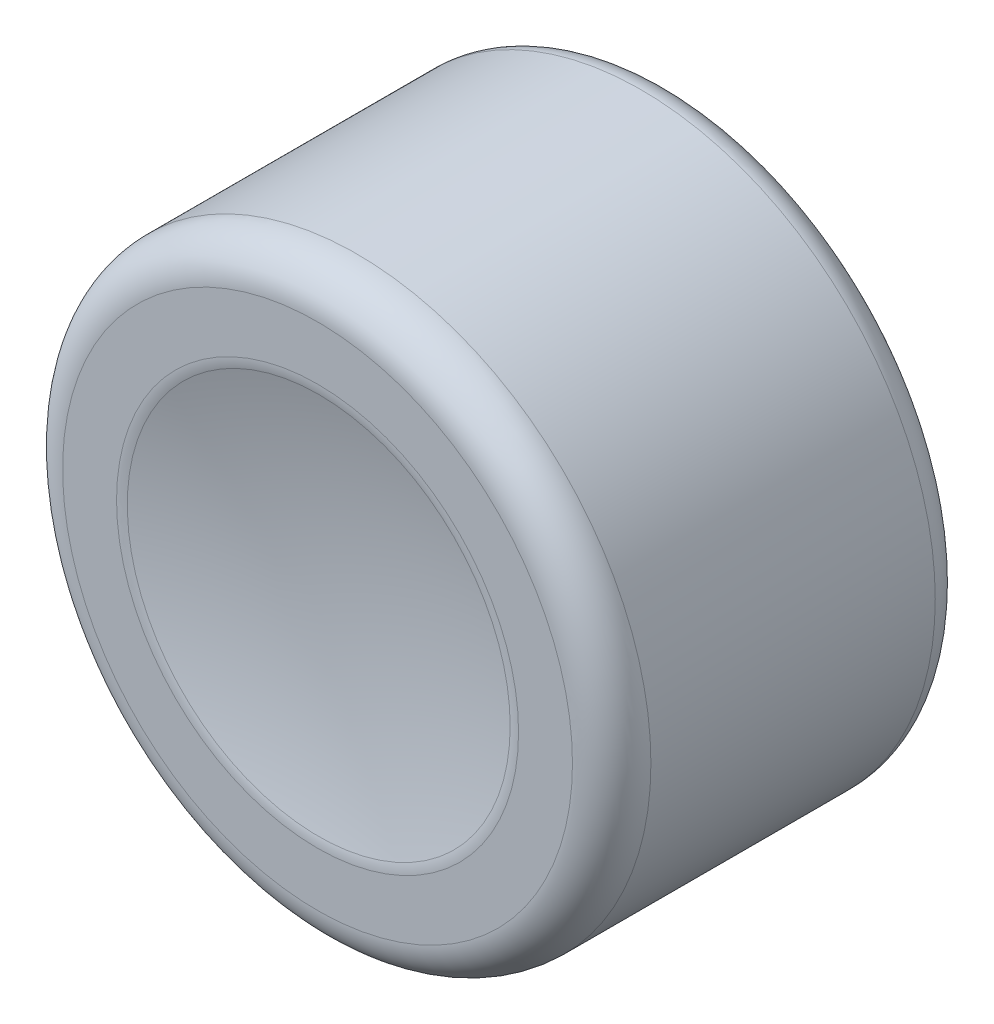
ISO-10303-21;
HEADER;
FILE_DESCRIPTION(('STEP AP214'),'2;1');
FILE_NAME('part.step','',(''),(''),'','','');
FILE_SCHEMA(('AUTOMOTIVE_DESIGN { 1 0 10303 214 1 1 1 1 }'));
ENDSEC;
DATA;
#1=APPLICATION_CONTEXT('core data for automotive mechanical design processes');
#2=APPLICATION_PROTOCOL_DEFINITION('international standard','automotive_design',2000,#1);
#3=PRODUCT_CONTEXT('',#1,'mechanical');
#4=PRODUCT('Part','Part','',(#3));
#5=PRODUCT_RELATED_PRODUCT_CATEGORY('part','',(#4));
#6=PRODUCT_DEFINITION_FORMATION('','',#4);
#7=PRODUCT_DEFINITION_CONTEXT('part definition',#1,'design');
#8=PRODUCT_DEFINITION('design','',#6,#7);
#9=PRODUCT_DEFINITION_SHAPE('','',#8);
#10=(LENGTH_UNIT() NAMED_UNIT(*) SI_UNIT(.MILLI.,.METRE.));
#11=(NAMED_UNIT(*) PLANE_ANGLE_UNIT() SI_UNIT($,.RADIAN.));
#12=(NAMED_UNIT(*) SI_UNIT($,.STERADIAN.) SOLID_ANGLE_UNIT());
#13=UNCERTAINTY_MEASURE_WITH_UNIT(LENGTH_MEASURE(1.E-05),#10,'distance_accuracy_value','');
#14=(GEOMETRIC_REPRESENTATION_CONTEXT(3) GLOBAL_UNCERTAINTY_ASSIGNED_CONTEXT((#13)) GLOBAL_UNIT_ASSIGNED_CONTEXT((#10,
#11,#12)) REPRESENTATION_CONTEXT('',''));
#15=CARTESIAN_POINT('',(0.,0.,0.));
#16=DIRECTION('',(0.,0.,1.));
#17=DIRECTION('',(1.,0.,0.));
#18=AXIS2_PLACEMENT_3D('',#15,#16,#17);
#19=CARTESIAN_POINT('',(0.,0.,18.));
#20=DIRECTION('',(0.,0.,-1.));
#21=DIRECTION('',(-1.,0.,0.));
#22=AXIS2_PLACEMENT_3D('',#19,#20,#21);
#23=CYLINDRICAL_SURFACE('',#22,15.);
#24=CARTESIAN_POINT('',(0.,0.,1.5));
#25=DIRECTION('',(0.,0.,1.));
#26=DIRECTION('',(1.,0.,0.));
#27=AXIS2_PLACEMENT_3D('',#24,#25,#26);
#28=CIRCLE('',#27,15.);
#29=CARTESIAN_POINT('',(15.,0.,1.5));
#30=VERTEX_POINT('',#29);
#31=EDGE_CURVE('E50',#30,#30,#28,.T.);
#32=ORIENTED_EDGE('',*,*,#31,.T.);
#33=EDGE_LOOP('',(#32));
#34=FACE_BOUND('',#33,.T.);
#35=CARTESIAN_POINT('',(0.,0.,16.));
#36=DIRECTION('',(0.,0.,1.));
#37=DIRECTION('',(1.,0.,0.));
#38=AXIS2_PLACEMENT_3D('',#35,#36,#37);
#39=CIRCLE('',#38,15.);
#40=CARTESIAN_POINT('',(15.,0.,16.));
#41=VERTEX_POINT('',#40);
#42=EDGE_CURVE('E56',#41,#41,#39,.F.);
#43=ORIENTED_EDGE('',*,*,#42,.T.);
#44=EDGE_LOOP('',(#43));
#45=FACE_BOUND('',#44,.T.);
#46=ADVANCED_FACE('F22',(#34,#45),#23,.T.);
#47=CARTESIAN_POINT('',(0.,0.,18.));
#48=DIRECTION('',(0.,0.,1.));
#49=DIRECTION('',(1.,0.,0.));
#50=AXIS2_PLACEMENT_3D('',#47,#48,#49);
#51=PLANE('',#50);
#52=CARTESIAN_POINT('',(0.,0.,18.));
#53=DIRECTION('',(0.,0.,1.));
#54=DIRECTION('',(1.,0.,0.));
#55=AXIS2_PLACEMENT_3D('',#52,#53,#54);
#56=CIRCLE('',#55,13.);
#57=CARTESIAN_POINT('',(13.,0.,18.));
#58=VERTEX_POINT('',#57);
#59=EDGE_CURVE('E59',#58,#58,#56,.T.);
#60=ORIENTED_EDGE('',*,*,#59,.T.);
#61=EDGE_LOOP('',(#60));
#62=FACE_BOUND('',#61,.T.);
#63=CARTESIAN_POINT('',(0.,0.,18.));
#64=DIRECTION('',(0.,0.,1.));
#65=DIRECTION('',(1.,0.,0.));
#66=AXIS2_PLACEMENT_3D('',#63,#64,#65);
#67=CIRCLE('',#66,10.2508861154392);
#68=CARTESIAN_POINT('',(10.2508861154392,0.,18.));
#69=VERTEX_POINT('',#68);
#70=EDGE_CURVE('E62',#69,#69,#67,.F.);
#71=ORIENTED_EDGE('',*,*,#70,.T.);
#72=EDGE_LOOP('',(#71));
#73=FACE_BOUND('',#72,.T.);
#74=ADVANCED_FACE('F66',(#62,#73),#51,.T.);
#75=CARTESIAN_POINT('',(0.,0.,0.));
#76=DIRECTION('',(0.,0.,1.));
#77=DIRECTION('',(1.,0.,0.));
#78=AXIS2_PLACEMENT_3D('',#75,#76,#77);
#79=PLANE('',#78);
#80=CARTESIAN_POINT('',(0.,0.,0.));
#81=DIRECTION('',(0.,0.,1.));
#82=DIRECTION('',(1.,0.,0.));
#83=AXIS2_PLACEMENT_3D('',#80,#81,#82);
#84=CIRCLE('',#83,13.);
#85=CARTESIAN_POINT('',(13.,0.,0.));
#86=VERTEX_POINT('',#85);
#87=EDGE_CURVE('E44',#86,#86,#84,.T.);
#88=ORIENTED_EDGE('',*,*,#87,.T.);
#89=EDGE_LOOP('',(#88));
#90=FACE_BOUND('',#89,.T.);
#91=CARTESIAN_POINT('',(0.,0.,0.));
#92=DIRECTION('',(0.,0.,1.));
#93=DIRECTION('',(1.,0.,0.));
#94=AXIS2_PLACEMENT_3D('',#91,#92,#93);
#95=CIRCLE('',#94,13.5);
#96=CARTESIAN_POINT('',(13.5,0.,0.));
#97=VERTEX_POINT('',#96);
#98=EDGE_CURVE('E47',#97,#97,#95,.F.);
#99=ORIENTED_EDGE('',*,*,#98,.T.);
#100=EDGE_LOOP('',(#99));
#101=FACE_BOUND('',#100,.T.);
#102=ADVANCED_FACE('F91',(#90,#101),#79,.F.);
#103=CARTESIAN_POINT('',(0.,0.,56.7298334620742));
#104=DIRECTION('',(0.,0.,-1.));
#105=DIRECTION('',(0.,1.,0.));
#106=AXIS2_PLACEMENT_3D('',#103,#104,#105);
#107=SPHERICAL_SURFACE('',#106,40.);
#108=CARTESIAN_POINT('',(0.,0.,17.9395158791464));
#109=DIRECTION('',(0.,0.,1.));
#110=DIRECTION('',(1.,0.,0.));
#111=AXIS2_PLACEMENT_3D('',#108,#109,#110);
#112=CIRCLE('',#111,9.76274868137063);
#113=CARTESIAN_POINT('',(9.76274868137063,0.,17.9395158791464));
#114=VERTEX_POINT('',#113);
#115=EDGE_CURVE('E53',#114,#114,#112,.T.);
#116=ORIENTED_EDGE('',*,*,#115,.T.);
#117=EDGE_LOOP('',(#116));
#118=FACE_BOUND('',#117,.T.);
#119=ADVANCED_FACE('F81',(#118),#107,.F.);
#120=CARTESIAN_POINT('',(0.,0.,16.));
#121=DIRECTION('',(0.,0.,1.));
#122=DIRECTION('',(1.,0.,0.));
#123=AXIS2_PLACEMENT_3D('',#120,#121,#122);
#124=TOROIDAL_SURFACE('',#123,13.,2.);
#125=ORIENTED_EDGE('',*,*,#42,.F.);
#126=EDGE_LOOP('',(#125));
#127=FACE_BOUND('',#126,.T.);
#128=ORIENTED_EDGE('',*,*,#59,.F.);
#129=EDGE_LOOP('',(#128));
#130=FACE_BOUND('',#129,.T.);
#131=ADVANCED_FACE('F71',(#127,#130),#124,.T.);
#132=CARTESIAN_POINT('',(0.,0.,16.));
#133=DIRECTION('',(0.,0.,1.));
#134=DIRECTION('',(1.,0.,0.));
#135=AXIS2_PLACEMENT_3D('',#132,#133,#134);
#136=TOROIDAL_SURFACE('',#135,10.2508861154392,2.);
#137=ORIENTED_EDGE('',*,*,#115,.F.);
#138=EDGE_LOOP('',(#137));
#139=FACE_BOUND('',#138,.T.);
#140=ORIENTED_EDGE('',*,*,#70,.F.);
#141=EDGE_LOOP('',(#140));
#142=FACE_BOUND('',#141,.T.);
#143=ADVANCED_FACE('F68',(#139,#142),#136,.T.);
#144=CARTESIAN_POINT('',(0.,0.,18.));
#145=DIRECTION('',(0.,0.,-1.));
#146=DIRECTION('',(-1.,0.,0.));
#147=AXIS2_PLACEMENT_3D('',#144,#145,#146);
#148=CYLINDRICAL_SURFACE('',#147,12.5);
#149=CARTESIAN_POINT('',(0.,0.,14.5));
#150=DIRECTION('',(0.,0.,1.));
#151=DIRECTION('',(1.,0.,0.));
#152=AXIS2_PLACEMENT_3D('',#149,#150,#151);
#153=CIRCLE('',#152,12.5);
#154=CARTESIAN_POINT('',(12.5,0.,14.5));
#155=VERTEX_POINT('',#154);
#156=EDGE_CURVE('E36',#155,#155,#153,.T.);
#157=ORIENTED_EDGE('',*,*,#156,.T.);
#158=EDGE_LOOP('',(#157));
#159=FACE_BOUND('',#158,.T.);
#160=CARTESIAN_POINT('',(0.,0.,0.500000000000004));
#161=DIRECTION('',(0.,0.,1.));
#162=DIRECTION('',(1.,0.,0.));
#163=AXIS2_PLACEMENT_3D('',#160,#161,#162);
#164=CIRCLE('',#163,12.5);
#165=CARTESIAN_POINT('',(12.5,0.,0.500000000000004));
#166=VERTEX_POINT('',#165);
#167=EDGE_CURVE('E41',#166,#166,#164,.F.);
#168=ORIENTED_EDGE('',*,*,#167,.T.);
#169=EDGE_LOOP('',(#168));
#170=FACE_BOUND('',#169,.T.);
#171=ADVANCED_FACE('F70',(#159,#170),#148,.F.);
#172=CARTESIAN_POINT('',(0.,0.,15.5));
#173=DIRECTION('',(0.,0.,1.));
#174=DIRECTION('',(1.,0.,0.));
#175=AXIS2_PLACEMENT_3D('',#172,#173,#174);
#176=PLANE('',#175);
#177=CARTESIAN_POINT('',(0.,0.,15.5));
#178=DIRECTION('',(0.,0.,1.));
#179=DIRECTION('',(1.,0.,0.));
#180=AXIS2_PLACEMENT_3D('',#177,#178,#179);
#181=CIRCLE('',#180,11.5);
#182=CARTESIAN_POINT('',(11.5,0.,15.5));
#183=VERTEX_POINT('',#182);
#184=EDGE_CURVE('E28',#183,#183,#181,.F.);
#185=ORIENTED_EDGE('',*,*,#184,.T.);
#186=EDGE_LOOP('',(#185));
#187=FACE_BOUND('',#186,.T.);
#188=CARTESIAN_POINT('',(0.,0.,15.5));
#189=DIRECTION('',(0.,0.,1.));
#190=DIRECTION('',(1.,0.,0.));
#191=AXIS2_PLACEMENT_3D('',#188,#189,#190);
#192=CIRCLE('',#191,10.4350929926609);
#193=CARTESIAN_POINT('',(10.4350929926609,0.,15.5));
#194=VERTEX_POINT('',#193);
#195=EDGE_CURVE('E32',#194,#194,#192,.T.);
#196=ORIENTED_EDGE('',*,*,#195,.T.);
#197=EDGE_LOOP('',(#196));
#198=FACE_BOUND('',#197,.T.);
#199=ADVANCED_FACE('F78',(#187,#198),#176,.F.);
#200=CARTESIAN_POINT('',(0.,0.,56.7298334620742));
#201=DIRECTION('',(0.,0.,-1.));
#202=DIRECTION('',(0.,1.,0.));
#203=AXIS2_PLACEMENT_3D('',#200,#201,#202);
#204=SPHERICAL_SURFACE('',#203,42.5);
#205=CARTESIAN_POINT('',(0.,0.,15.4708007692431));
#206=DIRECTION('',(0.,0.,1.));
#207=DIRECTION('',(1.,0.,0.));
#208=AXIS2_PLACEMENT_3D('',#205,#206,#207);
#209=CIRCLE('',#208,10.1952057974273);
#210=CARTESIAN_POINT('',(10.1952057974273,0.,15.4708007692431));
#211=VERTEX_POINT('',#210);
#212=EDGE_CURVE('E10',#211,#211,#209,.F.);
#213=ORIENTED_EDGE('',*,*,#212,.T.);
#214=EDGE_LOOP('',(#213));
#215=FACE_BOUND('',#214,.T.);
#216=ADVANCED_FACE('F102',(#215),#204,.T.);
#217=CARTESIAN_POINT('',(0.,0.,1.5));
#218=DIRECTION('',(0.,0.,1.));
#219=DIRECTION('',(1.,0.,0.));
#220=AXIS2_PLACEMENT_3D('',#217,#218,#219);
#221=TOROIDAL_SURFACE('',#220,13.5,1.5);
#222=ORIENTED_EDGE('',*,*,#98,.F.);
#223=EDGE_LOOP('',(#222));
#224=FACE_BOUND('',#223,.T.);
#225=ORIENTED_EDGE('',*,*,#31,.F.);
#226=EDGE_LOOP('',(#225));
#227=FACE_BOUND('',#226,.T.);
#228=ADVANCED_FACE('F99',(#224,#227),#221,.T.);
#229=CARTESIAN_POINT('',(0.,0.,0.));
#230=DIRECTION('',(0.,0.,-1.));
#231=DIRECTION('',(-1.,0.,0.));
#232=AXIS2_PLACEMENT_3D('',#229,#230,#231);
#233=CONICAL_SURFACE('',#232,13.,0.785398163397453);
#234=ORIENTED_EDGE('',*,*,#167,.F.);
#235=EDGE_LOOP('',(#234));
#236=FACE_BOUND('',#235,.T.);
#237=ORIENTED_EDGE('',*,*,#87,.F.);
#238=EDGE_LOOP('',(#237));
#239=FACE_BOUND('',#238,.T.);
#240=ADVANCED_FACE('F101',(#236,#239),#233,.F.);
#241=CARTESIAN_POINT('',(0.,0.,14.5));
#242=DIRECTION('',(0.,0.,1.));
#243=DIRECTION('',(1.,0.,0.));
#244=AXIS2_PLACEMENT_3D('',#241,#242,#243);
#245=TOROIDAL_SURFACE('',#244,11.5,1.);
#246=ORIENTED_EDGE('',*,*,#184,.F.);
#247=EDGE_LOOP('',(#246));
#248=FACE_BOUND('',#247,.T.);
#249=ORIENTED_EDGE('',*,*,#156,.F.);
#250=EDGE_LOOP('',(#249));
#251=FACE_BOUND('',#250,.T.);
#252=ADVANCED_FACE('F109',(#248,#251),#245,.F.);
#253=CARTESIAN_POINT('',(0.,0.,14.5));
#254=DIRECTION('',(0.,0.,1.));
#255=DIRECTION('',(1.,0.,0.));
#256=AXIS2_PLACEMENT_3D('',#253,#254,#255);
#257=TOROIDAL_SURFACE('',#256,10.4350929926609,1.);
#258=ORIENTED_EDGE('',*,*,#195,.F.);
#259=EDGE_LOOP('',(#258));
#260=FACE_BOUND('',#259,.T.);
#261=ORIENTED_EDGE('',*,*,#212,.F.);
#262=EDGE_LOOP('',(#261));
#263=FACE_BOUND('',#262,.T.);
#264=ADVANCED_FACE('F121',(#260,#263),#257,.F.);
#265=CLOSED_SHELL('',(#46,#74,#102,#119,#131,#143,#171,#199,#216,#228,#240,#252,#264));
#266=MANIFOLD_SOLID_BREP('B2',#265);
#267=ADVANCED_BREP_SHAPE_REPRESENTATION('',(#18,#266),#14);
#268=SHAPE_DEFINITION_REPRESENTATION(#9,#267);
ENDSEC;
END-ISO-10303-21;
